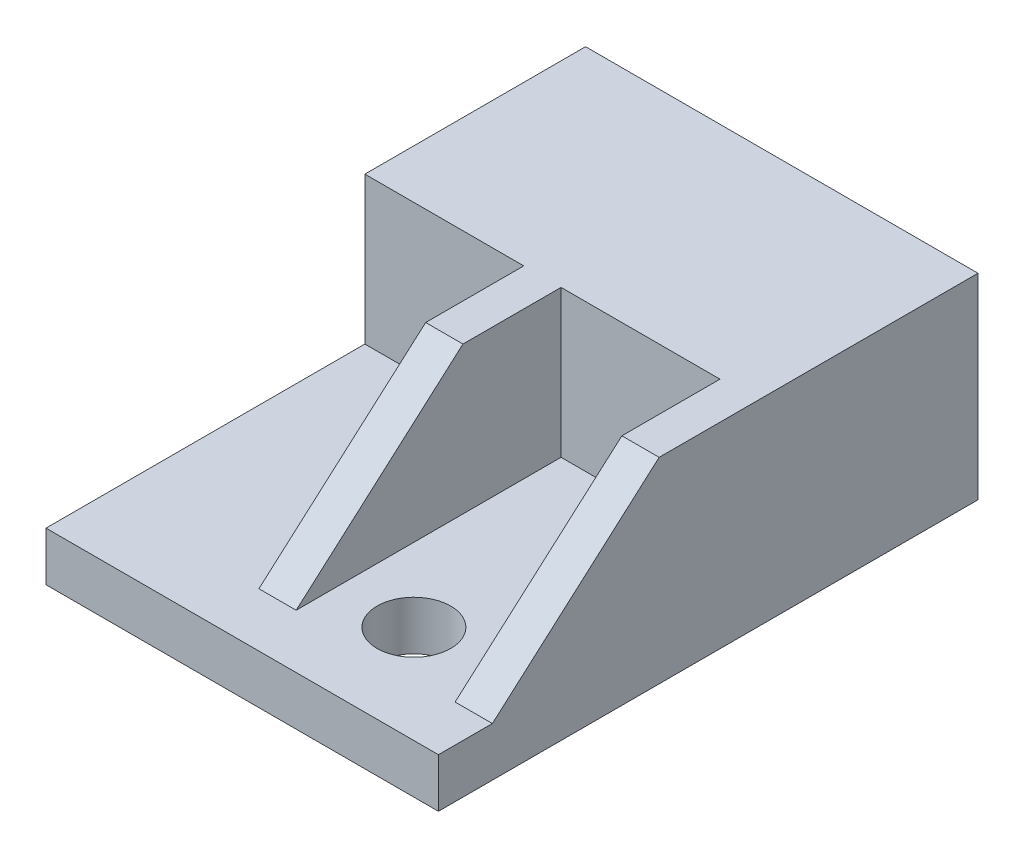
from build123d import *

# Parameters (mm, degrees)
BOSS_EXTRUDE3_DEPTH = 50.8
SKETCH1_7_R         = 9.525
SKETCH1_7_W         = 9.652
SKETCH1_7_H         = 43.18
BOSS_EXTRUDE5_DEPTH = 12.7
BOSS_EXTRUDE6_DEPTH = 9.652
SKETCH7_W           = 88.9
SKETCH7_H           = 44.45
CUT_EXTRUDE1_DEPTH  = 44.45
BOSS_EXTRUDE7_DEPTH = 9.652


with BuildPart() as part:
    # Sketch1 → Boss-Extrude3 (new body)
    with BuildSketch(Plane(origin=(0, 0, 0), x_dir=(1, 0, 0), z_dir=(0, 1, 0))):
        Polygon((0, 139.7), (-101.6, 139.7), (-101.6, 82.55), (-60.452, 82.55), (-60.452, 57.15), (-50.8, 57.15), (-50.8, 82.55), (-9.652, 82.55), (-9.652, 57.15), (0, 57.15), (0, 82.55), align=None)
    extrude(amount=BOSS_EXTRUDE3_DEPTH)

    # Sketch1_7 → Boss-Extrude5 (add)
    # profile 1 of 3: a face of its own
    with BuildSketch(Plane(origin=(0, 0, 0), x_dir=(1, 0, 0), z_dir=(0, 1, 0))):
        Polygon((-60.452, 82.55), (-101.6, 82.55), (-101.6, 0), (0, 0), (0, 13.97), (-9.652, 13.97), (-9.652, 57.15), (-9.652, 82.55), (-50.8, 82.55), (-50.8, 57.15), (-50.8, 13.97), (-60.452, 13.97), (-60.452, 57.15), align=None)
        with Locations(Location((-31.75, 25.4, 0), (0, 0, 270))):
            Circle(SKETCH1_7_R, mode=Mode.SUBTRACT)
    # profile 2 of 3: a face of its own
    with BuildSketch(Plane(origin=(0, 0, 0), x_dir=(1, 0, 0), z_dir=(0, 1, 0))):
        with Locations((-55.626, 35.56)):
            Rectangle(SKETCH1_7_W, SKETCH1_7_H)
    # profile 3 of 3: a face of its own
    with BuildSketch(Plane(origin=(0, 0, 0), x_dir=(1, 0, 0), z_dir=(0, 1, 0))):
        with Locations((-4.826, 35.56)):
            Rectangle(SKETCH1_7_W, SKETCH1_7_H)
    extrude(amount=BOSS_EXTRUDE5_DEPTH)

    # Sketch3 → Boss-Extrude6 (add)
    with BuildSketch(Plane(origin=(0, 0, 0), x_dir=(0, 0, -1), z_dir=(1, 0, 0))):
        Polygon((57.15, 12.7), (13.97, 12.7), (57.15, 50.8), align=None)
    extrude(amount=-BOSS_EXTRUDE6_DEPTH)

    # Sketch7 → Cut-Extrude1 (cut)
    with BuildSketch(Plane.XZ):
        with Locations((-50.8, -117.475)):
            Rectangle(SKETCH7_W, SKETCH7_H)
    extrude(amount=-CUT_EXTRUDE1_DEPTH, mode=Mode.SUBTRACT)

    # Sketch6 → Boss-Extrude7 (add)
    with BuildSketch(Plane(origin=(-50.8, 0, 0), x_dir=(0, 0, -1), z_dir=(1, 0, 0))):
        Polygon((57.15, 12.7), (57.15, 50.8), (13.97, 12.7), align=None)
    extrude(amount=-BOSS_EXTRUDE7_DEPTH)


solid = part.part
